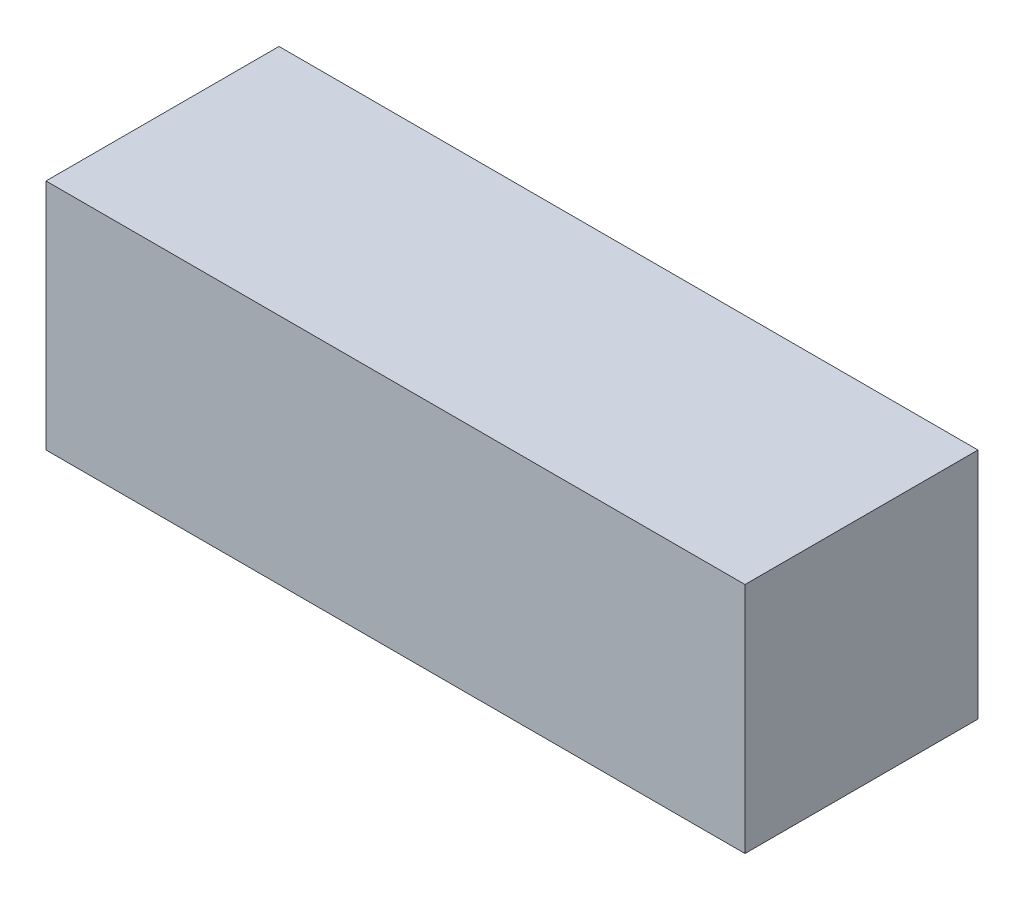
from build123d import *

# Parameters (mm, degrees)
CROQUIS1_W              = 30
CROQUIS1_H              = 10
SALIENTE_EXTRUIR1_DEPTH = 10


with BuildPart() as part:
    # Croquis1 → Saliente-Extruir1 (new body)
    with BuildSketch(Plane.XY):
        Rectangle(CROQUIS1_W, CROQUIS1_H)
    extrude(amount=SALIENTE_EXTRUIR1_DEPTH)


solid = part.part
